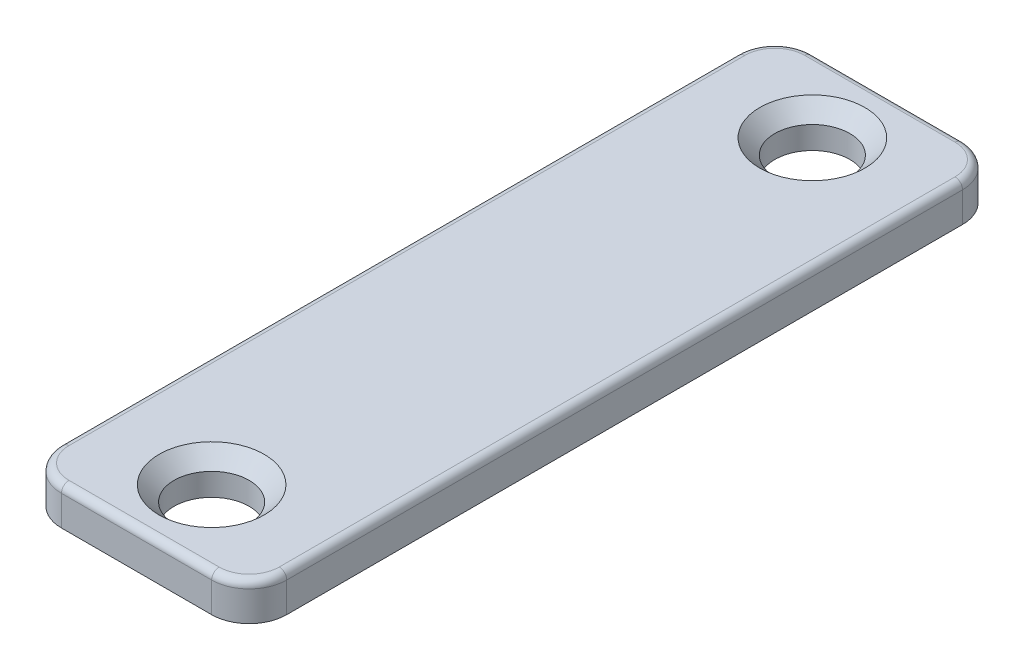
ISO-10303-21;
HEADER;
FILE_DESCRIPTION(('STEP AP214'),'2;1');
FILE_NAME('part.step','',(''),(''),'','','');
FILE_SCHEMA(('AUTOMOTIVE_DESIGN { 1 0 10303 214 1 1 1 1 }'));
ENDSEC;
DATA;
#1=APPLICATION_CONTEXT('core data for automotive mechanical design processes');
#2=APPLICATION_PROTOCOL_DEFINITION('international standard','automotive_design',2000,#1);
#3=PRODUCT_CONTEXT('',#1,'mechanical');
#4=PRODUCT('Part','Part','',(#3));
#5=PRODUCT_RELATED_PRODUCT_CATEGORY('part','',(#4));
#6=PRODUCT_DEFINITION_FORMATION('','',#4);
#7=PRODUCT_DEFINITION_CONTEXT('part definition',#1,'design');
#8=PRODUCT_DEFINITION('design','',#6,#7);
#9=PRODUCT_DEFINITION_SHAPE('','',#8);
#10=(LENGTH_UNIT() NAMED_UNIT(*) SI_UNIT(.MILLI.,.METRE.));
#11=(NAMED_UNIT(*) PLANE_ANGLE_UNIT() SI_UNIT($,.RADIAN.));
#12=(NAMED_UNIT(*) SI_UNIT($,.STERADIAN.) SOLID_ANGLE_UNIT());
#13=UNCERTAINTY_MEASURE_WITH_UNIT(LENGTH_MEASURE(1.E-05),#10,'distance_accuracy_value','');
#14=(GEOMETRIC_REPRESENTATION_CONTEXT(3) GLOBAL_UNCERTAINTY_ASSIGNED_CONTEXT((#13)) GLOBAL_UNIT_ASSIGNED_CONTEXT((#10,
#11,#12)) REPRESENTATION_CONTEXT('',''));
#15=CARTESIAN_POINT('',(0.,0.,0.));
#16=DIRECTION('',(0.,0.,1.));
#17=DIRECTION('',(1.,0.,0.));
#18=AXIS2_PLACEMENT_3D('',#15,#16,#17);
#19=CARTESIAN_POINT('',(1.,0.5,4.5));
#20=DIRECTION('',(0.,1.,0.));
#21=DIRECTION('',(0.,0.,1.));
#22=AXIS2_PLACEMENT_3D('',#19,#20,#21);
#23=PLANE('',#22);
#24=CARTESIAN_POINT('',(0.,0.5,4.));
#25=DIRECTION('',(0.,1.,0.));
#26=DIRECTION('',(0.,0.,1.));
#27=AXIS2_PLACEMENT_3D('',#24,#25,#26);
#28=CIRCLE('',#27,0.699999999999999);
#29=CARTESIAN_POINT('',(0.,0.5,4.7));
#30=VERTEX_POINT('',#29);
#31=EDGE_CURVE('E43',#30,#30,#28,.F.);
#32=ORIENTED_EDGE('',*,*,#31,.T.);
#33=EDGE_LOOP('',(#32));
#34=FACE_BOUND('',#33,.T.);
#35=CARTESIAN_POINT('',(0.,0.5,-4.));
#36=DIRECTION('',(0.,1.,0.));
#37=DIRECTION('',(0.,0.,1.));
#38=AXIS2_PLACEMENT_3D('',#35,#36,#37);
#39=CIRCLE('',#38,0.699999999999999);
#40=CARTESIAN_POINT('',(0.,0.5,-3.3));
#41=VERTEX_POINT('',#40);
#42=EDGE_CURVE('E238',#41,#41,#39,.F.);
#43=ORIENTED_EDGE('',*,*,#42,.T.);
#44=EDGE_LOOP('',(#43));
#45=FACE_BOUND('',#44,.T.);
#46=CARTESIAN_POINT('',(-1.,0.5,4.5));
#47=DIRECTION('',(0.,1.,0.));
#48=DIRECTION('',(0.,0.,1.));
#49=AXIS2_PLACEMENT_3D('',#46,#47,#48);
#50=CIRCLE('',#49,0.4);
#51=CARTESIAN_POINT('',(-1.4,0.5,4.5));
#52=VERTEX_POINT('',#51);
#53=CARTESIAN_POINT('',(-0.999999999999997,0.5,4.9));
#54=VERTEX_POINT('',#53);
#55=EDGE_CURVE('E193',#52,#54,#50,.T.);
#56=ORIENTED_EDGE('',*,*,#55,.T.);
#57=DIRECTION('',(1.,0.,0.));
#58=VECTOR('',#57,1.);
#59=CARTESIAN_POINT('',(0.999999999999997,0.5,4.9));
#60=LINE('',#59,#58);
#61=CARTESIAN_POINT('',(0.999999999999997,0.5,4.9));
#62=VERTEX_POINT('',#61);
#63=EDGE_CURVE('E195',#54,#62,#60,.T.);
#64=ORIENTED_EDGE('',*,*,#63,.T.);
#65=CARTESIAN_POINT('',(1.,0.5,4.5));
#66=DIRECTION('',(0.,1.,0.));
#67=DIRECTION('',(0.,0.,1.));
#68=AXIS2_PLACEMENT_3D('',#65,#66,#67);
#69=CIRCLE('',#68,0.4);
#70=CARTESIAN_POINT('',(1.4,0.5,4.5));
#71=VERTEX_POINT('',#70);
#72=EDGE_CURVE('E131',#62,#71,#69,.T.);
#73=ORIENTED_EDGE('',*,*,#72,.T.);
#74=DIRECTION('',(0.,0.,-1.));
#75=VECTOR('',#74,1.);
#76=CARTESIAN_POINT('',(1.4,0.5,-4.5));
#77=LINE('',#76,#75);
#78=CARTESIAN_POINT('',(1.4,0.5,-4.5));
#79=VERTEX_POINT('',#78);
#80=EDGE_CURVE('E183',#71,#79,#77,.T.);
#81=ORIENTED_EDGE('',*,*,#80,.T.);
#82=CARTESIAN_POINT('',(1.,0.5,-4.5));
#83=DIRECTION('',(0.,1.,0.));
#84=DIRECTION('',(0.,0.,1.));
#85=AXIS2_PLACEMENT_3D('',#82,#83,#84);
#86=CIRCLE('',#85,0.4);
#87=CARTESIAN_POINT('',(0.999999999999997,0.5,-4.9));
#88=VERTEX_POINT('',#87);
#89=EDGE_CURVE('E185',#79,#88,#86,.T.);
#90=ORIENTED_EDGE('',*,*,#89,.T.);
#91=DIRECTION('',(-1.,0.,0.));
#92=VECTOR('',#91,1.);
#93=CARTESIAN_POINT('',(-0.999999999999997,0.5,-4.9));
#94=LINE('',#93,#92);
#95=CARTESIAN_POINT('',(-0.999999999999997,0.5,-4.9));
#96=VERTEX_POINT('',#95);
#97=EDGE_CURVE('E187',#88,#96,#94,.T.);
#98=ORIENTED_EDGE('',*,*,#97,.T.);
#99=CARTESIAN_POINT('',(-1.,0.5,-4.5));
#100=DIRECTION('',(0.,1.,0.));
#101=DIRECTION('',(0.,0.,1.));
#102=AXIS2_PLACEMENT_3D('',#99,#100,#101);
#103=CIRCLE('',#102,0.4);
#104=CARTESIAN_POINT('',(-1.4,0.5,-4.5));
#105=VERTEX_POINT('',#104);
#106=EDGE_CURVE('E189',#96,#105,#103,.T.);
#107=ORIENTED_EDGE('',*,*,#106,.T.);
#108=DIRECTION('',(0.,0.,1.));
#109=VECTOR('',#108,1.);
#110=CARTESIAN_POINT('',(-1.4,0.5,4.5));
#111=LINE('',#110,#109);
#112=EDGE_CURVE('E191',#105,#52,#111,.T.);
#113=ORIENTED_EDGE('',*,*,#112,.T.);
#114=EDGE_LOOP('',(#56,#64,#73,#81,#90,#98,#107,#113));
#115=FACE_BOUND('',#114,.T.);
#116=ADVANCED_FACE('F35',(#34,#45,#115),#23,.T.);
#117=CARTESIAN_POINT('',(1.,0.,4.5));
#118=DIRECTION('',(0.,1.,0.));
#119=DIRECTION('',(0.,0.,1.));
#120=AXIS2_PLACEMENT_3D('',#117,#118,#119);
#121=PLANE('',#120);
#122=CARTESIAN_POINT('',(1.,0.,4.5));
#123=DIRECTION('',(0.,1.,0.));
#124=DIRECTION('',(0.,0.,1.));
#125=AXIS2_PLACEMENT_3D('',#122,#123,#124);
#126=CIRCLE('',#125,0.5);
#127=CARTESIAN_POINT('',(0.999999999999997,0.,5.));
#128=VERTEX_POINT('',#127);
#129=CARTESIAN_POINT('',(1.5,0.,4.5));
#130=VERTEX_POINT('',#129);
#131=EDGE_CURVE('E139',#128,#130,#126,.T.);
#132=ORIENTED_EDGE('',*,*,#131,.F.);
#133=DIRECTION('',(1.,0.,0.));
#134=VECTOR('',#133,1.);
#135=CARTESIAN_POINT('',(0.999999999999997,0.,5.));
#136=LINE('',#135,#134);
#137=CARTESIAN_POINT('',(-0.999999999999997,0.,5.));
#138=VERTEX_POINT('',#137);
#139=EDGE_CURVE('E168',#138,#128,#136,.T.);
#140=ORIENTED_EDGE('',*,*,#139,.F.);
#141=CARTESIAN_POINT('',(-1.,0.,4.5));
#142=DIRECTION('',(0.,1.,0.));
#143=DIRECTION('',(0.,0.,-1.));
#144=AXIS2_PLACEMENT_3D('',#141,#142,#143);
#145=CIRCLE('',#144,0.5);
#146=CARTESIAN_POINT('',(-1.5,0.,4.5));
#147=VERTEX_POINT('',#146);
#148=EDGE_CURVE('E165',#147,#138,#145,.T.);
#149=ORIENTED_EDGE('',*,*,#148,.F.);
#150=DIRECTION('',(0.,0.,1.));
#151=VECTOR('',#150,1.);
#152=CARTESIAN_POINT('',(-1.5,0.,4.5));
#153=LINE('',#152,#151);
#154=CARTESIAN_POINT('',(-1.5,0.,-4.5));
#155=VERTEX_POINT('',#154);
#156=EDGE_CURVE('E162',#155,#147,#153,.T.);
#157=ORIENTED_EDGE('',*,*,#156,.F.);
#158=CARTESIAN_POINT('',(-1.,0.,-4.5));
#159=DIRECTION('',(0.,1.,0.));
#160=DIRECTION('',(0.,0.,1.));
#161=AXIS2_PLACEMENT_3D('',#158,#159,#160);
#162=CIRCLE('',#161,0.5);
#163=CARTESIAN_POINT('',(-0.999999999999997,0.,-5.));
#164=VERTEX_POINT('',#163);
#165=EDGE_CURVE('E159',#164,#155,#162,.T.);
#166=ORIENTED_EDGE('',*,*,#165,.F.);
#167=DIRECTION('',(-1.,0.,0.));
#168=VECTOR('',#167,1.);
#169=CARTESIAN_POINT('',(0.999999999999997,0.,-5.));
#170=LINE('',#169,#168);
#171=CARTESIAN_POINT('',(0.999999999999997,0.,-5.));
#172=VERTEX_POINT('',#171);
#173=EDGE_CURVE('E156',#172,#164,#170,.T.);
#174=ORIENTED_EDGE('',*,*,#173,.F.);
#175=CARTESIAN_POINT('',(1.,0.,-4.5));
#176=DIRECTION('',(0.,1.,0.));
#177=DIRECTION('',(0.,0.,1.));
#178=AXIS2_PLACEMENT_3D('',#175,#176,#177);
#179=CIRCLE('',#178,0.5);
#180=CARTESIAN_POINT('',(1.5,0.,-4.5));
#181=VERTEX_POINT('',#180);
#182=EDGE_CURVE('E142',#181,#172,#179,.T.);
#183=ORIENTED_EDGE('',*,*,#182,.F.);
#184=DIRECTION('',(0.,0.,-1.));
#185=VECTOR('',#184,1.);
#186=CARTESIAN_POINT('',(1.5,0.,4.5));
#187=LINE('',#186,#185);
#188=EDGE_CURVE('E126',#130,#181,#187,.T.);
#189=ORIENTED_EDGE('',*,*,#188,.F.);
#190=EDGE_LOOP('',(#132,#140,#149,#157,#166,#174,#183,#189));
#191=FACE_BOUND('',#190,.T.);
#192=CARTESIAN_POINT('',(0.,0.,-4.));
#193=DIRECTION('',(0.,1.,0.));
#194=DIRECTION('',(0.,0.,1.));
#195=AXIS2_PLACEMENT_3D('',#192,#193,#194);
#196=CIRCLE('',#195,0.5);
#197=CARTESIAN_POINT('',(0.,0.,-3.5));
#198=VERTEX_POINT('',#197);
#199=EDGE_CURVE('E148',#198,#198,#196,.T.);
#200=ORIENTED_EDGE('',*,*,#199,.T.);
#201=EDGE_LOOP('',(#200));
#202=FACE_BOUND('',#201,.T.);
#203=CARTESIAN_POINT('',(0.,0.,4.));
#204=DIRECTION('',(0.,1.,0.));
#205=DIRECTION('',(0.,0.,1.));
#206=AXIS2_PLACEMENT_3D('',#203,#204,#205);
#207=CIRCLE('',#206,0.5);
#208=CARTESIAN_POINT('',(0.,0.,4.5));
#209=VERTEX_POINT('',#208);
#210=EDGE_CURVE('E151',#209,#209,#207,.T.);
#211=ORIENTED_EDGE('',*,*,#210,.T.);
#212=EDGE_LOOP('',(#211));
#213=FACE_BOUND('',#212,.T.);
#214=ADVANCED_FACE('F136',(#191,#202,#213),#121,.F.);
#215=CARTESIAN_POINT('',(1.,0.5,4.5));
#216=DIRECTION('',(0.,-1.,0.));
#217=DIRECTION('',(0.,0.,-1.));
#218=AXIS2_PLACEMENT_3D('',#215,#216,#217);
#219=CYLINDRICAL_SURFACE('',#218,0.5);
#220=DIRECTION('',(0.,-1.,0.));
#221=VECTOR('',#220,1.);
#222=CARTESIAN_POINT('',(1.5,0.5,4.5));
#223=LINE('',#222,#221);
#224=CARTESIAN_POINT('',(1.5,0.4,4.5));
#225=VERTEX_POINT('',#224);
#226=EDGE_CURVE('E123',#225,#130,#223,.T.);
#227=ORIENTED_EDGE('',*,*,#226,.F.);
#228=CARTESIAN_POINT('',(1.,0.4,4.5));
#229=DIRECTION('',(0.,1.,0.));
#230=DIRECTION('',(0.,0.,1.));
#231=AXIS2_PLACEMENT_3D('',#228,#229,#230);
#232=CIRCLE('',#231,0.5);
#233=CARTESIAN_POINT('',(0.999999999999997,0.4,5.));
#234=VERTEX_POINT('',#233);
#235=EDGE_CURVE('E211',#225,#234,#232,.F.);
#236=ORIENTED_EDGE('',*,*,#235,.T.);
#237=DIRECTION('',(0.,-1.,0.));
#238=VECTOR('',#237,1.);
#239=CARTESIAN_POINT('',(0.999999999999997,0.5,5.));
#240=LINE('',#239,#238);
#241=EDGE_CURVE('E146',#234,#128,#240,.T.);
#242=ORIENTED_EDGE('',*,*,#241,.T.);
#243=ORIENTED_EDGE('',*,*,#131,.T.);
#244=EDGE_LOOP('',(#227,#236,#242,#243));
#245=FACE_BOUND('',#244,.T.);
#246=ADVANCED_FACE('F144',(#245),#219,.T.);
#247=CARTESIAN_POINT('',(1.5,0.5,4.5));
#248=DIRECTION('',(-1.,0.,0.));
#249=DIRECTION('',(0.,0.,1.));
#250=AXIS2_PLACEMENT_3D('',#247,#248,#249);
#251=PLANE('',#250);
#252=DIRECTION('',(0.,-1.,0.));
#253=VECTOR('',#252,1.);
#254=CARTESIAN_POINT('',(1.5,0.5,-4.5));
#255=LINE('',#254,#253);
#256=CARTESIAN_POINT('',(1.5,0.4,-4.5));
#257=VERTEX_POINT('',#256);
#258=EDGE_CURVE('E132',#257,#181,#255,.T.);
#259=ORIENTED_EDGE('',*,*,#258,.F.);
#260=DIRECTION('',(0.,0.,-1.));
#261=VECTOR('',#260,1.);
#262=CARTESIAN_POINT('',(1.5,0.4,4.5));
#263=LINE('',#262,#261);
#264=EDGE_CURVE('E50',#257,#225,#263,.F.);
#265=ORIENTED_EDGE('',*,*,#264,.T.);
#266=ORIENTED_EDGE('',*,*,#226,.T.);
#267=ORIENTED_EDGE('',*,*,#188,.T.);
#268=EDGE_LOOP('',(#259,#265,#266,#267));
#269=FACE_BOUND('',#268,.T.);
#270=ADVANCED_FACE('F125',(#269),#251,.F.);
#271=CARTESIAN_POINT('',(1.,0.5,-4.5));
#272=DIRECTION('',(0.,-1.,0.));
#273=DIRECTION('',(0.,0.,-1.));
#274=AXIS2_PLACEMENT_3D('',#271,#272,#273);
#275=CYLINDRICAL_SURFACE('',#274,0.5);
#276=DIRECTION('',(0.,-1.,0.));
#277=VECTOR('',#276,1.);
#278=CARTESIAN_POINT('',(0.999999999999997,0.5,-5.));
#279=LINE('',#278,#277);
#280=CARTESIAN_POINT('',(0.999999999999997,0.4,-5.));
#281=VERTEX_POINT('',#280);
#282=EDGE_CURVE('E179',#281,#172,#279,.T.);
#283=ORIENTED_EDGE('',*,*,#282,.F.);
#284=CARTESIAN_POINT('',(1.,0.4,-4.5));
#285=DIRECTION('',(0.,1.,0.));
#286=DIRECTION('',(0.,0.,1.));
#287=AXIS2_PLACEMENT_3D('',#284,#285,#286);
#288=CIRCLE('',#287,0.5);
#289=EDGE_CURVE('E58',#281,#257,#288,.F.);
#290=ORIENTED_EDGE('',*,*,#289,.T.);
#291=ORIENTED_EDGE('',*,*,#258,.T.);
#292=ORIENTED_EDGE('',*,*,#182,.T.);
#293=EDGE_LOOP('',(#283,#290,#291,#292));
#294=FACE_BOUND('',#293,.T.);
#295=ADVANCED_FACE('F289',(#294),#275,.T.);
#296=CARTESIAN_POINT('',(0.999999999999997,0.5,-5.));
#297=DIRECTION('',(0.,0.,1.));
#298=DIRECTION('',(1.,0.,0.));
#299=AXIS2_PLACEMENT_3D('',#296,#297,#298);
#300=PLANE('',#299);
#301=DIRECTION('',(0.,-1.,0.));
#302=VECTOR('',#301,1.);
#303=CARTESIAN_POINT('',(-0.999999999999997,0.5,-5.));
#304=LINE('',#303,#302);
#305=CARTESIAN_POINT('',(-0.999999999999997,0.4,-5.));
#306=VERTEX_POINT('',#305);
#307=EDGE_CURVE('E177',#306,#164,#304,.T.);
#308=ORIENTED_EDGE('',*,*,#307,.F.);
#309=DIRECTION('',(-1.,0.,0.));
#310=VECTOR('',#309,1.);
#311=CARTESIAN_POINT('',(0.999999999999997,0.4,-5.));
#312=LINE('',#311,#310);
#313=EDGE_CURVE('E207',#306,#281,#312,.F.);
#314=ORIENTED_EDGE('',*,*,#313,.T.);
#315=ORIENTED_EDGE('',*,*,#282,.T.);
#316=ORIENTED_EDGE('',*,*,#173,.T.);
#317=EDGE_LOOP('',(#308,#314,#315,#316));
#318=FACE_BOUND('',#317,.T.);
#319=ADVANCED_FACE('F285',(#318),#300,.F.);
#320=CARTESIAN_POINT('',(-1.,0.5,-4.5));
#321=DIRECTION('',(0.,-1.,0.));
#322=DIRECTION('',(0.,0.,-1.));
#323=AXIS2_PLACEMENT_3D('',#320,#321,#322);
#324=CYLINDRICAL_SURFACE('',#323,0.5);
#325=DIRECTION('',(0.,-1.,0.));
#326=VECTOR('',#325,1.);
#327=CARTESIAN_POINT('',(-1.5,0.5,-4.5));
#328=LINE('',#327,#326);
#329=CARTESIAN_POINT('',(-1.5,0.4,-4.5));
#330=VERTEX_POINT('',#329);
#331=EDGE_CURVE('E175',#330,#155,#328,.T.);
#332=ORIENTED_EDGE('',*,*,#331,.F.);
#333=CARTESIAN_POINT('',(-1.,0.4,-4.5));
#334=DIRECTION('',(0.,1.,0.));
#335=DIRECTION('',(0.,0.,1.));
#336=AXIS2_PLACEMENT_3D('',#333,#334,#335);
#337=CIRCLE('',#336,0.5);
#338=EDGE_CURVE('E205',#330,#306,#337,.F.);
#339=ORIENTED_EDGE('',*,*,#338,.T.);
#340=ORIENTED_EDGE('',*,*,#307,.T.);
#341=ORIENTED_EDGE('',*,*,#165,.T.);
#342=EDGE_LOOP('',(#332,#339,#340,#341));
#343=FACE_BOUND('',#342,.T.);
#344=ADVANCED_FACE('F281',(#343),#324,.T.);
#345=CARTESIAN_POINT('',(-1.5,0.5,4.5));
#346=DIRECTION('',(1.,0.,0.));
#347=DIRECTION('',(0.,0.,-1.));
#348=AXIS2_PLACEMENT_3D('',#345,#346,#347);
#349=PLANE('',#348);
#350=DIRECTION('',(0.,-1.,0.));
#351=VECTOR('',#350,1.);
#352=CARTESIAN_POINT('',(-1.5,0.5,4.5));
#353=LINE('',#352,#351);
#354=CARTESIAN_POINT('',(-1.5,0.4,4.5));
#355=VERTEX_POINT('',#354);
#356=EDGE_CURVE('E173',#355,#147,#353,.T.);
#357=ORIENTED_EDGE('',*,*,#356,.F.);
#358=DIRECTION('',(0.,0.,1.));
#359=VECTOR('',#358,1.);
#360=CARTESIAN_POINT('',(-1.5,0.4,-4.5));
#361=LINE('',#360,#359);
#362=EDGE_CURVE('E203',#355,#330,#361,.F.);
#363=ORIENTED_EDGE('',*,*,#362,.T.);
#364=ORIENTED_EDGE('',*,*,#331,.T.);
#365=ORIENTED_EDGE('',*,*,#156,.T.);
#366=EDGE_LOOP('',(#357,#363,#364,#365));
#367=FACE_BOUND('',#366,.T.);
#368=ADVANCED_FACE('F277',(#367),#349,.F.);
#369=CARTESIAN_POINT('',(-1.,0.5,4.5));
#370=DIRECTION('',(0.,-1.,0.));
#371=DIRECTION('',(0.,0.,-1.));
#372=AXIS2_PLACEMENT_3D('',#369,#370,#371);
#373=CYLINDRICAL_SURFACE('',#372,0.5);
#374=DIRECTION('',(0.,-1.,0.));
#375=VECTOR('',#374,1.);
#376=CARTESIAN_POINT('',(-0.999999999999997,0.5,5.));
#377=LINE('',#376,#375);
#378=CARTESIAN_POINT('',(-0.999999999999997,0.4,5.));
#379=VERTEX_POINT('',#378);
#380=EDGE_CURVE('E171',#379,#138,#377,.T.);
#381=ORIENTED_EDGE('',*,*,#380,.F.);
#382=CARTESIAN_POINT('',(-1.,0.4,4.5));
#383=DIRECTION('',(0.,1.,0.));
#384=DIRECTION('',(0.,0.,1.));
#385=AXIS2_PLACEMENT_3D('',#382,#383,#384);
#386=CIRCLE('',#385,0.5);
#387=EDGE_CURVE('E201',#379,#355,#386,.F.);
#388=ORIENTED_EDGE('',*,*,#387,.T.);
#389=ORIENTED_EDGE('',*,*,#356,.T.);
#390=ORIENTED_EDGE('',*,*,#148,.T.);
#391=EDGE_LOOP('',(#381,#388,#389,#390));
#392=FACE_BOUND('',#391,.T.);
#393=ADVANCED_FACE('F273',(#392),#373,.T.);
#394=CARTESIAN_POINT('',(0.999999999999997,0.5,5.));
#395=DIRECTION('',(0.,0.,-1.));
#396=DIRECTION('',(-1.,0.,0.));
#397=AXIS2_PLACEMENT_3D('',#394,#395,#396);
#398=PLANE('',#397);
#399=ORIENTED_EDGE('',*,*,#241,.F.);
#400=DIRECTION('',(1.,0.,0.));
#401=VECTOR('',#400,1.);
#402=CARTESIAN_POINT('',(-0.999999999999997,0.4,5.));
#403=LINE('',#402,#401);
#404=EDGE_CURVE('E198',#234,#379,#403,.F.);
#405=ORIENTED_EDGE('',*,*,#404,.T.);
#406=ORIENTED_EDGE('',*,*,#380,.T.);
#407=ORIENTED_EDGE('',*,*,#139,.T.);
#408=EDGE_LOOP('',(#399,#405,#406,#407));
#409=FACE_BOUND('',#408,.T.);
#410=ADVANCED_FACE('F270',(#409),#398,.F.);
#411=CARTESIAN_POINT('',(0.,0.5,-4.));
#412=DIRECTION('',(0.,-1.,0.));
#413=DIRECTION('',(0.,0.,-1.));
#414=AXIS2_PLACEMENT_3D('',#411,#412,#413);
#415=CYLINDRICAL_SURFACE('',#414,0.5);
#416=CARTESIAN_POINT('',(0.,0.3,-4.));
#417=DIRECTION('',(0.,1.,0.));
#418=DIRECTION('',(0.,0.,1.));
#419=AXIS2_PLACEMENT_3D('',#416,#417,#418);
#420=CIRCLE('',#419,0.5);
#421=CARTESIAN_POINT('',(0.,0.3,-3.5));
#422=VERTEX_POINT('',#421);
#423=EDGE_CURVE('E11',#422,#422,#420,.T.);
#424=ORIENTED_EDGE('',*,*,#423,.T.);
#425=EDGE_LOOP('',(#424));
#426=FACE_BOUND('',#425,.T.);
#427=ORIENTED_EDGE('',*,*,#199,.F.);
#428=EDGE_LOOP('',(#427));
#429=FACE_BOUND('',#428,.T.);
#430=ADVANCED_FACE('F255',(#426,#429),#415,.F.);
#431=CARTESIAN_POINT('',(0.,0.5,4.));
#432=DIRECTION('',(0.,-1.,0.));
#433=DIRECTION('',(0.,0.,-1.));
#434=AXIS2_PLACEMENT_3D('',#431,#432,#433);
#435=CYLINDRICAL_SURFACE('',#434,0.5);
#436=CARTESIAN_POINT('',(0.,0.3,4.));
#437=DIRECTION('',(0.,1.,0.));
#438=DIRECTION('',(0.,0.,1.));
#439=AXIS2_PLACEMENT_3D('',#436,#437,#438);
#440=CIRCLE('',#439,0.5);
#441=CARTESIAN_POINT('',(0.,0.3,4.5));
#442=VERTEX_POINT('',#441);
#443=EDGE_CURVE('E213',#442,#442,#440,.T.);
#444=ORIENTED_EDGE('',*,*,#443,.T.);
#445=EDGE_LOOP('',(#444));
#446=FACE_BOUND('',#445,.T.);
#447=ORIENTED_EDGE('',*,*,#210,.F.);
#448=EDGE_LOOP('',(#447));
#449=FACE_BOUND('',#448,.T.);
#450=ADVANCED_FACE('F251',(#446,#449),#435,.F.);
#451=CARTESIAN_POINT('',(1.,0.4,-4.9));
#452=DIRECTION('',(1.,0.,0.));
#453=DIRECTION('',(0.,0.,-1.));
#454=AXIS2_PLACEMENT_3D('',#451,#452,#453);
#455=CYLINDRICAL_SURFACE('',#454,0.1);
#456=CARTESIAN_POINT('',(0.999999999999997,0.4,-4.9));
#457=DIRECTION('',(1.,0.,0.));
#458=DIRECTION('',(0.,0.,-1.));
#459=AXIS2_PLACEMENT_3D('',#456,#457,#458);
#460=CIRCLE('',#459,0.1);
#461=EDGE_CURVE('E230',#281,#88,#460,.T.);
#462=ORIENTED_EDGE('',*,*,#461,.F.);
#463=ORIENTED_EDGE('',*,*,#313,.F.);
#464=CARTESIAN_POINT('',(-0.999999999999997,0.4,-4.9));
#465=DIRECTION('',(-1.,0.,0.));
#466=DIRECTION('',(0.,0.,1.));
#467=AXIS2_PLACEMENT_3D('',#464,#465,#466);
#468=CIRCLE('',#467,0.1);
#469=EDGE_CURVE('E233',#96,#306,#468,.T.);
#470=ORIENTED_EDGE('',*,*,#469,.F.);
#471=ORIENTED_EDGE('',*,*,#97,.F.);
#472=EDGE_LOOP('',(#462,#463,#470,#471));
#473=FACE_BOUND('',#472,.T.);
#474=ADVANCED_FACE('F254',(#473),#455,.T.);
#475=CARTESIAN_POINT('',(-1.,0.4,-4.5));
#476=DIRECTION('',(0.,1.,0.));
#477=DIRECTION('',(0.,0.,1.));
#478=AXIS2_PLACEMENT_3D('',#475,#476,#477);
#479=TOROIDAL_SURFACE('',#478,0.4,0.1);
#480=ORIENTED_EDGE('',*,*,#469,.T.);
#481=ORIENTED_EDGE('',*,*,#338,.F.);
#482=CARTESIAN_POINT('',(-1.4,0.4,-4.5));
#483=DIRECTION('',(0.,0.,1.));
#484=DIRECTION('',(1.,0.,0.));
#485=AXIS2_PLACEMENT_3D('',#482,#483,#484);
#486=CIRCLE('',#485,0.1);
#487=EDGE_CURVE('E227',#105,#330,#486,.T.);
#488=ORIENTED_EDGE('',*,*,#487,.F.);
#489=ORIENTED_EDGE('',*,*,#106,.F.);
#490=EDGE_LOOP('',(#480,#481,#488,#489));
#491=FACE_BOUND('',#490,.T.);
#492=ADVANCED_FACE('F317',(#491),#479,.T.);
#493=CARTESIAN_POINT('',(1.,0.4,-4.5));
#494=DIRECTION('',(0.,1.,0.));
#495=DIRECTION('',(0.,0.,1.));
#496=AXIS2_PLACEMENT_3D('',#493,#494,#495);
#497=TOROIDAL_SURFACE('',#496,0.4,0.1);
#498=ORIENTED_EDGE('',*,*,#461,.T.);
#499=ORIENTED_EDGE('',*,*,#89,.F.);
#500=CARTESIAN_POINT('',(1.4,0.4,-4.5));
#501=DIRECTION('',(0.,0.,1.));
#502=DIRECTION('',(1.,0.,0.));
#503=AXIS2_PLACEMENT_3D('',#500,#501,#502);
#504=CIRCLE('',#503,0.1);
#505=EDGE_CURVE('E224',#257,#79,#504,.T.);
#506=ORIENTED_EDGE('',*,*,#505,.F.);
#507=ORIENTED_EDGE('',*,*,#289,.F.);
#508=EDGE_LOOP('',(#498,#499,#506,#507));
#509=FACE_BOUND('',#508,.T.);
#510=ADVANCED_FACE('F313',(#509),#497,.T.);
#511=CARTESIAN_POINT('',(-1.4,0.4,4.5));
#512=DIRECTION('',(0.,0.,-1.));
#513=DIRECTION('',(-1.,0.,0.));
#514=AXIS2_PLACEMENT_3D('',#511,#512,#513);
#515=CYLINDRICAL_SURFACE('',#514,0.1);
#516=ORIENTED_EDGE('',*,*,#487,.T.);
#517=ORIENTED_EDGE('',*,*,#362,.F.);
#518=CARTESIAN_POINT('',(-1.4,0.4,4.5));
#519=DIRECTION('',(0.,0.,1.));
#520=DIRECTION('',(1.,0.,0.));
#521=AXIS2_PLACEMENT_3D('',#518,#519,#520);
#522=CIRCLE('',#521,0.1);
#523=EDGE_CURVE('E221',#52,#355,#522,.T.);
#524=ORIENTED_EDGE('',*,*,#523,.F.);
#525=ORIENTED_EDGE('',*,*,#112,.F.);
#526=EDGE_LOOP('',(#516,#517,#524,#525));
#527=FACE_BOUND('',#526,.T.);
#528=ADVANCED_FACE('F309',(#527),#515,.T.);
#529=CARTESIAN_POINT('',(1.4,0.4,4.5));
#530=DIRECTION('',(0.,0.,1.));
#531=DIRECTION('',(1.,0.,0.));
#532=AXIS2_PLACEMENT_3D('',#529,#530,#531);
#533=CYLINDRICAL_SURFACE('',#532,0.1);
#534=ORIENTED_EDGE('',*,*,#505,.T.);
#535=ORIENTED_EDGE('',*,*,#80,.F.);
#536=CARTESIAN_POINT('',(1.4,0.4,4.5));
#537=DIRECTION('',(0.,0.,1.));
#538=DIRECTION('',(1.,0.,0.));
#539=AXIS2_PLACEMENT_3D('',#536,#537,#538);
#540=CIRCLE('',#539,0.1);
#541=EDGE_CURVE('E218',#225,#71,#540,.T.);
#542=ORIENTED_EDGE('',*,*,#541,.F.);
#543=ORIENTED_EDGE('',*,*,#264,.F.);
#544=EDGE_LOOP('',(#534,#535,#542,#543));
#545=FACE_BOUND('',#544,.T.);
#546=ADVANCED_FACE('F305',(#545),#533,.T.);
#547=CARTESIAN_POINT('',(-1.,0.4,4.5));
#548=DIRECTION('',(0.,1.,0.));
#549=DIRECTION('',(0.,0.,1.));
#550=AXIS2_PLACEMENT_3D('',#547,#548,#549);
#551=TOROIDAL_SURFACE('',#550,0.4,0.1);
#552=ORIENTED_EDGE('',*,*,#523,.T.);
#553=ORIENTED_EDGE('',*,*,#387,.F.);
#554=CARTESIAN_POINT('',(-0.999999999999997,0.4,4.9));
#555=DIRECTION('',(1.,0.,0.));
#556=DIRECTION('',(0.,0.,-1.));
#557=AXIS2_PLACEMENT_3D('',#554,#555,#556);
#558=CIRCLE('',#557,0.1);
#559=EDGE_CURVE('E216',#54,#379,#558,.T.);
#560=ORIENTED_EDGE('',*,*,#559,.F.);
#561=ORIENTED_EDGE('',*,*,#55,.F.);
#562=EDGE_LOOP('',(#552,#553,#560,#561));
#563=FACE_BOUND('',#562,.T.);
#564=ADVANCED_FACE('F301',(#563),#551,.T.);
#565=CARTESIAN_POINT('',(1.,0.4,4.5));
#566=DIRECTION('',(0.,1.,0.));
#567=DIRECTION('',(0.,0.,1.));
#568=AXIS2_PLACEMENT_3D('',#565,#566,#567);
#569=TOROIDAL_SURFACE('',#568,0.4,0.1);
#570=ORIENTED_EDGE('',*,*,#541,.T.);
#571=ORIENTED_EDGE('',*,*,#72,.F.);
#572=CARTESIAN_POINT('',(0.999999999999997,0.4,4.9));
#573=DIRECTION('',(-1.,0.,0.));
#574=DIRECTION('',(0.,0.,1.));
#575=AXIS2_PLACEMENT_3D('',#572,#573,#574);
#576=CIRCLE('',#575,0.1);
#577=EDGE_CURVE('E214',#234,#62,#576,.T.);
#578=ORIENTED_EDGE('',*,*,#577,.F.);
#579=ORIENTED_EDGE('',*,*,#235,.F.);
#580=EDGE_LOOP('',(#570,#571,#578,#579));
#581=FACE_BOUND('',#580,.T.);
#582=ADVANCED_FACE('F297',(#581),#569,.T.);
#583=CARTESIAN_POINT('',(1.,0.4,4.9));
#584=DIRECTION('',(-1.,0.,0.));
#585=DIRECTION('',(0.,0.,1.));
#586=AXIS2_PLACEMENT_3D('',#583,#584,#585);
#587=CYLINDRICAL_SURFACE('',#586,0.1);
#588=ORIENTED_EDGE('',*,*,#559,.T.);
#589=ORIENTED_EDGE('',*,*,#404,.F.);
#590=ORIENTED_EDGE('',*,*,#577,.T.);
#591=ORIENTED_EDGE('',*,*,#63,.F.);
#592=EDGE_LOOP('',(#588,#589,#590,#591));
#593=FACE_BOUND('',#592,.T.);
#594=ADVANCED_FACE('F248',(#593),#587,.T.);
#595=CARTESIAN_POINT('',(0.,0.3,4.));
#596=DIRECTION('',(0.,1.,0.));
#597=DIRECTION('',(0.,0.,1.));
#598=AXIS2_PLACEMENT_3D('',#595,#596,#597);
#599=CONICAL_SURFACE('',#598,0.5,0.785398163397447);
#600=CARTESIAN_POINT('',(0.,0.5,4.7));
#601=CARTESIAN_POINT('',(0.,0.497916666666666,4.69791666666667));
#602=CARTESIAN_POINT('',(0.,0.495833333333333,4.69583333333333));
#603=CARTESIAN_POINT('',(0.,0.491666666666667,4.69166666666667));
#604=CARTESIAN_POINT('',(0.,0.489583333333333,4.68958333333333));
#605=CARTESIAN_POINT('',(0.,0.485416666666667,4.68541666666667));
#606=CARTESIAN_POINT('',(0.,0.483333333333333,4.68333333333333));
#607=CARTESIAN_POINT('',(0.,0.479166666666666,4.67916666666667));
#608=CARTESIAN_POINT('',(0.,0.477083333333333,4.67708333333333));
#609=CARTESIAN_POINT('',(0.,0.472916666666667,4.67291666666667));
#610=CARTESIAN_POINT('',(0.,0.470833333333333,4.67083333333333));
#611=CARTESIAN_POINT('',(0.,0.466666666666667,4.66666666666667));
#612=CARTESIAN_POINT('',(0.,0.464583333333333,4.66458333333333));
#613=CARTESIAN_POINT('',(0.,0.460416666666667,4.66041666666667));
#614=CARTESIAN_POINT('',(0.,0.458333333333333,4.65833333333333));
#615=CARTESIAN_POINT('',(0.,0.454166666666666,4.65416666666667));
#616=CARTESIAN_POINT('',(0.,0.452083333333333,4.65208333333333));
#617=CARTESIAN_POINT('',(0.,0.447916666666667,4.64791666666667));
#618=CARTESIAN_POINT('',(0.,0.445833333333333,4.64583333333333));
#619=CARTESIAN_POINT('',(0.,0.441666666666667,4.64166666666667));
#620=CARTESIAN_POINT('',(0.,0.439583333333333,4.63958333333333));
#621=CARTESIAN_POINT('',(0.,0.435416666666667,4.63541666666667));
#622=CARTESIAN_POINT('',(0.,0.433333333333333,4.63333333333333));
#623=CARTESIAN_POINT('',(0.,0.429166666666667,4.62916666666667));
#624=CARTESIAN_POINT('',(0.,0.427083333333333,4.62708333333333));
#625=CARTESIAN_POINT('',(0.,0.422916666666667,4.62291666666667));
#626=CARTESIAN_POINT('',(0.,0.420833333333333,4.62083333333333));
#627=CARTESIAN_POINT('',(0.,0.416666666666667,4.61666666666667));
#628=CARTESIAN_POINT('',(0.,0.414583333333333,4.61458333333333));
#629=CARTESIAN_POINT('',(0.,0.410416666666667,4.61041666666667));
#630=CARTESIAN_POINT('',(0.,0.408333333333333,4.60833333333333));
#631=CARTESIAN_POINT('',(0.,0.404166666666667,4.60416666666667));
#632=CARTESIAN_POINT('',(0.,0.402083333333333,4.60208333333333));
#633=CARTESIAN_POINT('',(0.,0.397916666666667,4.59791666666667));
#634=CARTESIAN_POINT('',(0.,0.395833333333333,4.59583333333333));
#635=CARTESIAN_POINT('',(0.,0.391666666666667,4.59166666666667));
#636=CARTESIAN_POINT('',(0.,0.389583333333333,4.58958333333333));
#637=CARTESIAN_POINT('',(0.,0.385416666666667,4.58541666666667));
#638=CARTESIAN_POINT('',(0.,0.383333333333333,4.58333333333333));
#639=CARTESIAN_POINT('',(0.,0.379166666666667,4.57916666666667));
#640=CARTESIAN_POINT('',(0.,0.377083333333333,4.57708333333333));
#641=CARTESIAN_POINT('',(0.,0.372916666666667,4.57291666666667));
#642=CARTESIAN_POINT('',(0.,0.370833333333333,4.57083333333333));
#643=CARTESIAN_POINT('',(0.,0.366666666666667,4.56666666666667));
#644=CARTESIAN_POINT('',(0.,0.364583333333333,4.56458333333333));
#645=CARTESIAN_POINT('',(0.,0.360416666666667,4.56041666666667));
#646=CARTESIAN_POINT('',(0.,0.358333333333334,4.55833333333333));
#647=CARTESIAN_POINT('',(0.,0.354166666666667,4.55416666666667));
#648=CARTESIAN_POINT('',(0.,0.352083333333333,4.55208333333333));
#649=CARTESIAN_POINT('',(0.,0.347916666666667,4.54791666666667));
#650=CARTESIAN_POINT('',(0.,0.345833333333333,4.54583333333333));
#651=CARTESIAN_POINT('',(0.,0.341666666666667,4.54166666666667));
#652=CARTESIAN_POINT('',(0.,0.339583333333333,4.53958333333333));
#653=CARTESIAN_POINT('',(0.,0.335416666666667,4.53541666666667));
#654=CARTESIAN_POINT('',(0.,0.333333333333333,4.53333333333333));
#655=CARTESIAN_POINT('',(0.,0.329166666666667,4.52916666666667));
#656=CARTESIAN_POINT('',(0.,0.327083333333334,4.52708333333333));
#657=CARTESIAN_POINT('',(0.,0.322916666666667,4.52291666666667));
#658=CARTESIAN_POINT('',(0.,0.320833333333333,4.52083333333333));
#659=CARTESIAN_POINT('',(0.,0.316666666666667,4.51666666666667));
#660=CARTESIAN_POINT('',(0.,0.314583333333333,4.51458333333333));
#661=CARTESIAN_POINT('',(0.,0.310416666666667,4.51041666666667));
#662=CARTESIAN_POINT('',(0.,0.308333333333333,4.50833333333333));
#663=CARTESIAN_POINT('',(0.,0.304166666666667,4.50416666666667));
#664=CARTESIAN_POINT('',(0.,0.302083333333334,4.50208333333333));
#665=CARTESIAN_POINT('',(0.,0.3,4.5));
#666=B_SPLINE_CURVE_WITH_KNOTS('',3,(#600,#601,#602,#603,#604,#605,#606,#607,#608,#609,#610,
#611,#612,#613,#614,#615,#616,#617,#618,#619,#620,#621,#622,#623,#624,#625,#626,#627,#628,#629,
#630,#631,#632,#633,#634,#635,#636,#637,#638,#639,#640,#641,#642,#643,#644,#645,#646,#647,#648,
#649,#650,#651,#652,#653,#654,#655,#656,#657,#658,#659,#660,#661,#662,#663,#664,#665),
.UNSPECIFIED.,.F.,.F.,(4,2,2,2,2,2,2,2,2,2,2,2,2,2,2,2,2,2,2,2,2,2,2,2,2,2,2,2,2,2,2,2,4),(0.,
0.00883883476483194,0.0176776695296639,0.0265165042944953,0.0353553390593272,0.0441941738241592,
0.0530330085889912,0.0618718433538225,0.0707106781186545,0.0795495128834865,0.0883883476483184,
0.0972271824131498,0.106066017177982,0.114904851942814,0.123743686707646,0.132582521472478,
0.141421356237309,0.150260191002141,0.159099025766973,0.167937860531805,0.176776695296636,
0.185615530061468,0.1944543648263,0.203293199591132,0.212132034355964,0.220970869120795,
0.229809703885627,0.238648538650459,0.247487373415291,0.256326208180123,0.265165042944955,
0.274003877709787,0.282842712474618),.UNSPECIFIED.);
#667=EDGE_CURVE('BSEAM245',#30,#442,#666,.T.);
#668=ORIENTED_EDGE('',*,*,#31,.F.);
#669=ORIENTED_EDGE('',*,*,#443,.F.);
#670=ORIENTED_EDGE('',*,*,#667,.T.);
#671=ORIENTED_EDGE('',*,*,#667,.F.);
#672=EDGE_LOOP('',(#668,#670,#669,#671));
#673=FACE_BOUND('',#672,.T.);
#674=ADVANCED_FACE('F245',(#673),#599,.F.);
#675=CARTESIAN_POINT('',(0.,0.3,-4.));
#676=DIRECTION('',(0.,1.,0.));
#677=DIRECTION('',(0.,0.,1.));
#678=AXIS2_PLACEMENT_3D('',#675,#676,#677);
#679=CONICAL_SURFACE('',#678,0.5,0.785398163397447);
#680=CARTESIAN_POINT('',(0.,0.5,-3.3));
#681=CARTESIAN_POINT('',(0.,0.497916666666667,-3.30208333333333));
#682=CARTESIAN_POINT('',(0.,0.495833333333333,-3.30416666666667));
#683=CARTESIAN_POINT('',(0.,0.491666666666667,-3.30833333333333));
#684=CARTESIAN_POINT('',(0.,0.489583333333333,-3.31041666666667));
#685=CARTESIAN_POINT('',(0.,0.485416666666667,-3.31458333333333));
#686=CARTESIAN_POINT('',(0.,0.483333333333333,-3.31666666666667));
#687=CARTESIAN_POINT('',(0.,0.479166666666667,-3.32083333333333));
#688=CARTESIAN_POINT('',(0.,0.477083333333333,-3.32291666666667));
#689=CARTESIAN_POINT('',(0.,0.472916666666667,-3.32708333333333));
#690=CARTESIAN_POINT('',(0.,0.470833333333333,-3.32916666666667));
#691=CARTESIAN_POINT('',(0.,0.466666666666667,-3.33333333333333));
#692=CARTESIAN_POINT('',(0.,0.464583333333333,-3.33541666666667));
#693=CARTESIAN_POINT('',(0.,0.460416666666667,-3.33958333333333));
#694=CARTESIAN_POINT('',(0.,0.458333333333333,-3.34166666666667));
#695=CARTESIAN_POINT('',(0.,0.454166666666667,-3.34583333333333));
#696=CARTESIAN_POINT('',(0.,0.452083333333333,-3.34791666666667));
#697=CARTESIAN_POINT('',(0.,0.447916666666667,-3.35208333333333));
#698=CARTESIAN_POINT('',(0.,0.445833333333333,-3.35416666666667));
#699=CARTESIAN_POINT('',(0.,0.441666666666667,-3.35833333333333));
#700=CARTESIAN_POINT('',(0.,0.439583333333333,-3.36041666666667));
#701=CARTESIAN_POINT('',(0.,0.435416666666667,-3.36458333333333));
#702=CARTESIAN_POINT('',(0.,0.433333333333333,-3.36666666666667));
#703=CARTESIAN_POINT('',(0.,0.429166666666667,-3.37083333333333));
#704=CARTESIAN_POINT('',(0.,0.427083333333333,-3.37291666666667));
#705=CARTESIAN_POINT('',(0.,0.422916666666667,-3.37708333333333));
#706=CARTESIAN_POINT('',(0.,0.420833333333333,-3.37916666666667));
#707=CARTESIAN_POINT('',(0.,0.416666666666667,-3.38333333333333));
#708=CARTESIAN_POINT('',(0.,0.414583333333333,-3.38541666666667));
#709=CARTESIAN_POINT('',(0.,0.410416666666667,-3.38958333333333));
#710=CARTESIAN_POINT('',(0.,0.408333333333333,-3.39166666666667));
#711=CARTESIAN_POINT('',(0.,0.404166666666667,-3.39583333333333));
#712=CARTESIAN_POINT('',(0.,0.402083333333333,-3.39791666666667));
#713=CARTESIAN_POINT('',(0.,0.397916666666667,-3.40208333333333));
#714=CARTESIAN_POINT('',(0.,0.395833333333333,-3.40416666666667));
#715=CARTESIAN_POINT('',(0.,0.391666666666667,-3.40833333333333));
#716=CARTESIAN_POINT('',(0.,0.389583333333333,-3.41041666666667));
#717=CARTESIAN_POINT('',(0.,0.385416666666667,-3.41458333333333));
#718=CARTESIAN_POINT('',(0.,0.383333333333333,-3.41666666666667));
#719=CARTESIAN_POINT('',(0.,0.379166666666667,-3.42083333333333));
#720=CARTESIAN_POINT('',(0.,0.377083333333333,-3.42291666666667));
#721=CARTESIAN_POINT('',(0.,0.372916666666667,-3.42708333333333));
#722=CARTESIAN_POINT('',(0.,0.370833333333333,-3.42916666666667));
#723=CARTESIAN_POINT('',(0.,0.366666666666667,-3.43333333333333));
#724=CARTESIAN_POINT('',(0.,0.364583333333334,-3.43541666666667));
#725=CARTESIAN_POINT('',(0.,0.360416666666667,-3.43958333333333));
#726=CARTESIAN_POINT('',(0.,0.358333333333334,-3.44166666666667));
#727=CARTESIAN_POINT('',(0.,0.354166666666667,-3.44583333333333));
#728=CARTESIAN_POINT('',(0.,0.352083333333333,-3.44791666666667));
#729=CARTESIAN_POINT('',(0.,0.347916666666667,-3.45208333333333));
#730=CARTESIAN_POINT('',(0.,0.345833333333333,-3.45416666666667));
#731=CARTESIAN_POINT('',(0.,0.341666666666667,-3.45833333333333));
#732=CARTESIAN_POINT('',(0.,0.339583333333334,-3.46041666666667));
#733=CARTESIAN_POINT('',(0.,0.335416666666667,-3.46458333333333));
#734=CARTESIAN_POINT('',(0.,0.333333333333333,-3.46666666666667));
#735=CARTESIAN_POINT('',(0.,0.329166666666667,-3.47083333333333));
#736=CARTESIAN_POINT('',(0.,0.327083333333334,-3.47291666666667));
#737=CARTESIAN_POINT('',(0.,0.322916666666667,-3.47708333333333));
#738=CARTESIAN_POINT('',(0.,0.320833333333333,-3.47916666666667));
#739=CARTESIAN_POINT('',(0.,0.316666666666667,-3.48333333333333));
#740=CARTESIAN_POINT('',(0.,0.314583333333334,-3.48541666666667));
#741=CARTESIAN_POINT('',(0.,0.310416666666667,-3.48958333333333));
#742=CARTESIAN_POINT('',(0.,0.308333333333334,-3.49166666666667));
#743=CARTESIAN_POINT('',(0.,0.304166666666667,-3.49583333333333));
#744=CARTESIAN_POINT('',(0.,0.302083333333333,-3.49791666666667));
#745=CARTESIAN_POINT('',(0.,0.3,-3.5));
#746=B_SPLINE_CURVE_WITH_KNOTS('',3,(#680,#681,#682,#683,#684,#685,#686,#687,#688,#689,#690,
#691,#692,#693,#694,#695,#696,#697,#698,#699,#700,#701,#702,#703,#704,#705,#706,#707,#708,#709,
#710,#711,#712,#713,#714,#715,#716,#717,#718,#719,#720,#721,#722,#723,#724,#725,#726,#727,#728,
#729,#730,#731,#732,#733,#734,#735,#736,#737,#738,#739,#740,#741,#742,#743,#744,#745),
.UNSPECIFIED.,.F.,.F.,(4,2,2,2,2,2,2,2,2,2,2,2,2,2,2,2,2,2,2,2,2,2,2,2,2,2,2,2,2,2,2,2,4),(0.,
0.00883883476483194,0.0176776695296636,0.0265165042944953,0.0353553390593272,0.0441941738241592,
0.0530330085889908,0.0618718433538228,0.0707106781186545,0.0795495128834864,0.0883883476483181,
0.0972271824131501,0.106066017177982,0.114904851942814,0.123743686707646,0.132582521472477,
0.141421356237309,0.150260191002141,0.159099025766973,0.167937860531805,0.176776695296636,
0.185615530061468,0.1944543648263,0.203293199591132,0.212132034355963,0.220970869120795,
0.229809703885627,0.238648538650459,0.247487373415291,0.256326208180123,0.265165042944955,
0.274003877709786,0.282842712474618),.UNSPECIFIED.);
#747=EDGE_CURVE('BSEAM37',#41,#422,#746,.T.);
#748=ORIENTED_EDGE('',*,*,#42,.F.);
#749=ORIENTED_EDGE('',*,*,#423,.F.);
#750=ORIENTED_EDGE('',*,*,#747,.T.);
#751=ORIENTED_EDGE('',*,*,#747,.F.);
#752=EDGE_LOOP('',(#748,#750,#749,#751));
#753=FACE_BOUND('',#752,.T.);
#754=ADVANCED_FACE('F37',(#753),#679,.F.);
#755=CLOSED_SHELL('',(#116,#214,#246,#270,#295,#319,#344,#368,#393,#410,#430,#450,#474,#492,
#510,#528,#546,#564,#582,#594,#674,#754));
#756=MANIFOLD_SOLID_BREP('B2',#755);
#757=ADVANCED_BREP_SHAPE_REPRESENTATION('',(#18,#756),#14);
#758=SHAPE_DEFINITION_REPRESENTATION(#9,#757);
ENDSEC;
END-ISO-10303-21;
